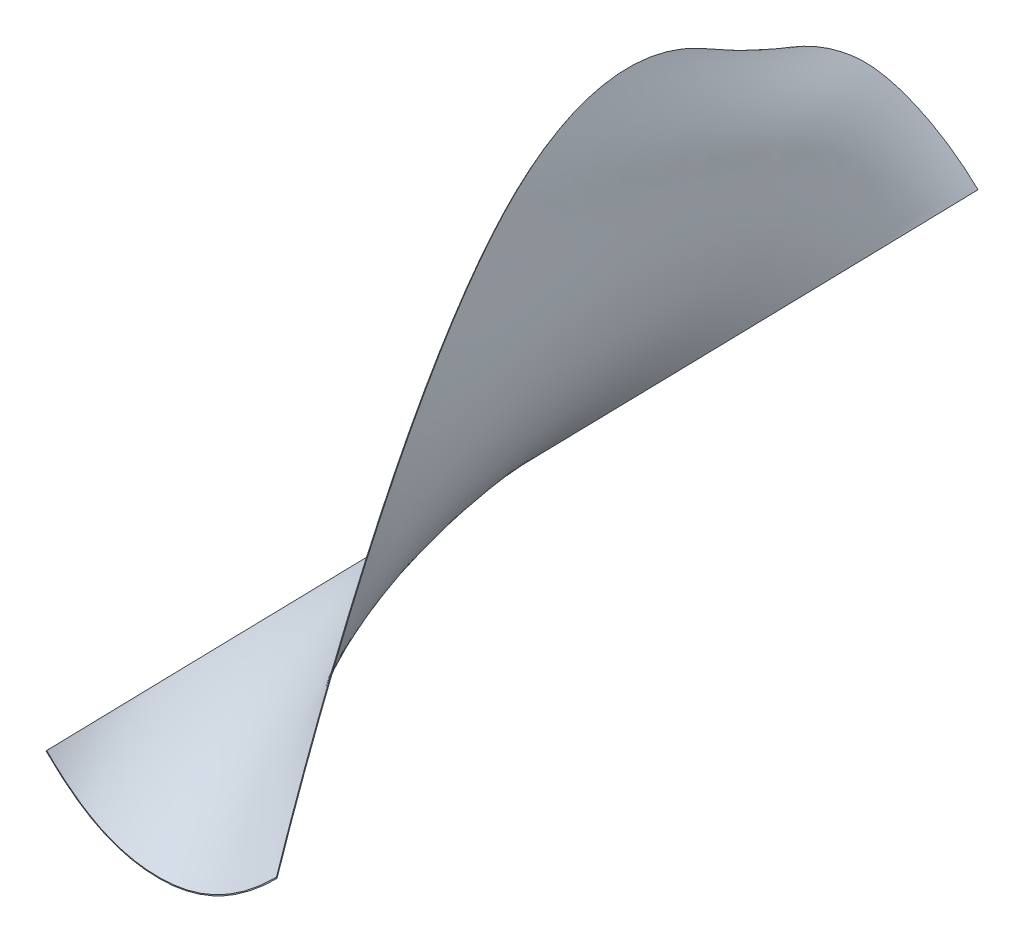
ISO-10303-21;
HEADER;
FILE_DESCRIPTION(('STEP AP214'),'2;1');
FILE_NAME('part.step','',(''),(''),'','','');
FILE_SCHEMA(('AUTOMOTIVE_DESIGN { 1 0 10303 214 1 1 1 1 }'));
ENDSEC;
DATA;
#1=APPLICATION_CONTEXT('core data for automotive mechanical design processes');
#2=APPLICATION_PROTOCOL_DEFINITION('international standard','automotive_design',2000,#1);
#3=PRODUCT_CONTEXT('',#1,'mechanical');
#4=PRODUCT('Part','Part','',(#3));
#5=PRODUCT_RELATED_PRODUCT_CATEGORY('part','',(#4));
#6=PRODUCT_DEFINITION_FORMATION('','',#4);
#7=PRODUCT_DEFINITION_CONTEXT('part definition',#1,'design');
#8=PRODUCT_DEFINITION('design','',#6,#7);
#9=PRODUCT_DEFINITION_SHAPE('','',#8);
#10=(LENGTH_UNIT() NAMED_UNIT(*) SI_UNIT(.MILLI.,.METRE.));
#11=(NAMED_UNIT(*) PLANE_ANGLE_UNIT() SI_UNIT($,.RADIAN.));
#12=(NAMED_UNIT(*) SI_UNIT($,.STERADIAN.) SOLID_ANGLE_UNIT());
#13=UNCERTAINTY_MEASURE_WITH_UNIT(LENGTH_MEASURE(1.E-05),#10,'distance_accuracy_value','');
#14=(GEOMETRIC_REPRESENTATION_CONTEXT(3) GLOBAL_UNCERTAINTY_ASSIGNED_CONTEXT((#13)) GLOBAL_UNIT_ASSIGNED_CONTEXT((#10,
#11,#12)) REPRESENTATION_CONTEXT('',''));
#15=CARTESIAN_POINT('',(0.,0.,0.));
#16=DIRECTION('',(0.,0.,1.));
#17=DIRECTION('',(1.,0.,0.));
#18=AXIS2_PLACEMENT_3D('',#15,#16,#17);
#19=CARTESIAN_POINT('',(-127.735476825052,61.9614146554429,0.));
#20=DIRECTION('',(0.,0.,1.));
#21=DIRECTION('',(1.,0.,0.));
#22=AXIS2_PLACEMENT_3D('',#19,#20,#21);
#23=PLANE('',#22);
#24=CARTESIAN_POINT('',(-249.646446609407,-0.353553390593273,0.));
#25=CARTESIAN_POINT('',(-248.407781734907,0.885111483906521,0.));
#26=CARTESIAN_POINT('',(-245.897723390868,3.34805729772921,0.));
#27=CARTESIAN_POINT('',(-240.859649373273,8.10657595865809,0.));
#28=CARTESIAN_POINT('',(-234.484704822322,13.7904329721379,0.));
#29=CARTESIAN_POINT('',(-226.748220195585,20.1697131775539,0.));
#30=CARTESIAN_POINT('',(-216.340461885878,28.088997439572,0.));
#31=CARTESIAN_POINT('',(-203.213565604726,36.8792838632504,0.));
#32=CARTESIAN_POINT('',(-187.444698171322,45.6330219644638,0.));
#33=CARTESIAN_POINT('',(-171.830910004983,52.5707445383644,0.));
#34=CARTESIAN_POINT('',(-156.545796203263,57.6718646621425,0.));
#35=CARTESIAN_POINT('',(-144.221045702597,60.3747674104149,0.));
#36=CARTESIAN_POINT('',(-134.705792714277,61.5998340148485,0.));
#37=CARTESIAN_POINT('',(-125.410326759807,62.1921800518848,0.));
#38=CARTESIAN_POINT('',(-113.810247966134,61.6924292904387,0.));
#39=CARTESIAN_POINT('',(-98.8242234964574,58.9477901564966,0.));
#40=CARTESIAN_POINT('',(-83.1223347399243,54.195149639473,0.));
#41=CARTESIAN_POINT('',(-61.671413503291,45.3620229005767,0.));
#42=CARTESIAN_POINT('',(-40.115954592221,33.0607640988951,0.));
#43=CARTESIAN_POINT('',(-19.7790161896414,17.8429951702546,0.));
#44=CARTESIAN_POINT('',(-10.2407698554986,9.35821942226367,0.));
#45=CARTESIAN_POINT('',(-5.68060886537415,4.91653393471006,0.));
#46=B_SPLINE_CURVE_WITH_KNOTS('',3,(#24,#25,#26,#27,#28,#29,#30,#31,#32,#33,#34,#35,#36,#37,#38,
#39,#40,#41,#42,#43,#44,#45),.UNSPECIFIED.,.F.,.F.,(4,1,1,1,1,1,1,1,1,1,1,1,1,1,1,1,1,1,1,4),
(0.,0.00778621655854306,0.0155724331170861,0.0311448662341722,0.0467172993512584,
0.0622897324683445,0.0934345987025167,0.124579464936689,0.155724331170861,0.186869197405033,
0.218014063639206,0.233586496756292,0.249158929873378,0.28030379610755,0.311448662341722,
0.342593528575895,0.373738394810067,0.436028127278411,0.467172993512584,0.498317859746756),.UNSPECIFIED.);
#47=CARTESIAN_POINT('',(-249.646446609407,-0.353553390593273,0.));
#48=VERTEX_POINT('',#47);
#49=CARTESIAN_POINT('',(-5.68060886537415,4.91653393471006,0.));
#50=VERTEX_POINT('',#49);
#51=EDGE_CURVE('E203',#48,#50,#46,.T.);
#52=ORIENTED_EDGE('',*,*,#51,.F.);
#53=DIRECTION('',(0.707106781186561,-0.707106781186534,0.));
#54=VECTOR('',#53,1.);
#55=CARTESIAN_POINT('',(-249.646446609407,-0.353553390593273,0.));
#56=LINE('',#55,#54);
#57=CARTESIAN_POINT('',(-250.353553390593,0.353553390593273,0.));
#58=VERTEX_POINT('',#57);
#59=EDGE_CURVE('E223',#58,#48,#56,.T.);
#60=ORIENTED_EDGE('',*,*,#59,.F.);
#61=CARTESIAN_POINT('',(-4.9828689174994,5.63288508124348,0.));
#62=CARTESIAN_POINT('',(-9.56389602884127,10.0948945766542,0.));
#63=CARTESIAN_POINT('',(-19.1466458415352,18.6192566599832,0.));
#64=CARTESIAN_POINT('',(-39.5712553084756,33.9023453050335,0.));
#65=CARTESIAN_POINT('',(-61.2204393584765,46.2578440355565,0.));
#66=CARTESIAN_POINT('',(-82.7829554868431,55.1374322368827,0.));
#67=CARTESIAN_POINT('',(-98.5830480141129,59.9203342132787,0.));
#68=CARTESIAN_POINT('',(-113.690339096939,62.6885425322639,0.));
#69=CARTESIAN_POINT('',(-125.41629141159,63.1942272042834,0.));
#70=CARTESIAN_POINT('',(-134.803431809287,62.5957392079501,0.));
#71=CARTESIAN_POINT('',(-144.399430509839,61.3601288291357,0.));
#72=CARTESIAN_POINT('',(-156.815635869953,58.6367114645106,0.));
#73=CARTESIAN_POINT('',(-172.195808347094,53.5034203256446,0.));
#74=CARTESIAN_POINT('',(-187.893439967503,46.5281387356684,0.));
#75=CARTESIAN_POINT('',(-203.73701408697,37.7326879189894,0.));
#76=CARTESIAN_POINT('',(-216.920029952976,28.9046707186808,0.));
#77=CARTESIAN_POINT('',(-227.369610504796,20.9535397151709,0.));
#78=CARTESIAN_POINT('',(-235.136038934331,14.5495503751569,0.));
#79=CARTESIAN_POINT('',(-241.534825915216,8.84442386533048,0.));
#80=CARTESIAN_POINT('',(-246.591354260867,4.06847125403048,0.));
#81=CARTESIAN_POINT('',(-249.11042041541,1.59668636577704,0.));
#82=CARTESIAN_POINT('',(-250.353553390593,0.353553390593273,0.));
#83=B_SPLINE_CURVE_WITH_KNOTS('',3,(#61,#62,#63,#64,#65,#66,#67,#68,#69,#70,#71,#72,#73,#74,#75,
#76,#77,#78,#79,#80,#81,#82),.UNSPECIFIED.,.F.,.F.,(4,1,1,1,1,1,1,1,1,1,1,1,1,1,1,1,1,1,1,4),
(0.,0.0311448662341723,0.0622897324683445,0.124579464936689,0.155724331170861,0.186869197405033,
0.218014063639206,0.249158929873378,0.264731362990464,0.28030379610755,0.311448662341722,
0.342593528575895,0.373738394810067,0.404883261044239,0.436028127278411,0.451600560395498,
0.467172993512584,0.48274542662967,0.490531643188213,0.498317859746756),.UNSPECIFIED.);
#84=CARTESIAN_POINT('',(-4.9828689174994,5.63288508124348,0.));
#85=VERTEX_POINT('',#84);
#86=EDGE_CURVE('E197',#85,#58,#83,.T.);
#87=ORIENTED_EDGE('',*,*,#86,.F.);
#88=DIRECTION('',(0.697739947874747,0.71635114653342,0.));
#89=VECTOR('',#88,1.);
#90=CARTESIAN_POINT('',(-5.68060886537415,4.91653393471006,0.));
#91=LINE('',#90,#89);
#92=EDGE_CURVE('E201',#50,#85,#91,.T.);
#93=ORIENTED_EDGE('',*,*,#92,.F.);
#94=EDGE_LOOP('',(#52,#60,#87,#93));
#95=FACE_BOUND('',#94,.T.);
#96=ADVANCED_FACE('F158',(#95),#23,.F.);
#97=CARTESIAN_POINT('',(128.853857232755,-62.9487383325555,1000.));
#98=DIRECTION('',(0.,0.,-1.));
#99=DIRECTION('',(-1.,0.,0.));
#100=AXIS2_PLACEMENT_3D('',#97,#98,#99);
#101=PLANE('',#100);
#102=CARTESIAN_POINT('',(4.9474801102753,-5.66012274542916,1000.));
#103=CARTESIAN_POINT('',(7.081143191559,-7.78774388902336,1000.));
#104=CARTESIAN_POINT('',(11.4194054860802,-12.0076426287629,1000.));
#105=CARTESIAN_POINT('',(20.1857361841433,-20.0624301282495,1000.));
#106=CARTESIAN_POINT('',(31.4479700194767,-29.4502876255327,1000.));
#107=CARTESIAN_POINT('',(45.5383930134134,-39.4131309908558,1000.));
#108=CARTESIAN_POINT('',(60.3322342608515,-47.8980998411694,1000.));
#109=CARTESIAN_POINT('',(75.9454882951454,-54.7187372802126,1000.));
#110=CARTESIAN_POINT('',(92.4961984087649,-59.6911074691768,1000.));
#111=CARTESIAN_POINT('',(110.097369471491,-62.6314048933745,1000.));
#112=CARTESIAN_POINT('',(125.742650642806,-63.2358319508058,1000.));
#113=CARTESIAN_POINT('',(138.205326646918,-62.4954365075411,1000.));
#114=CARTESIAN_POINT('',(150.392681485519,-60.8894422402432,1000.));
#115=CARTESIAN_POINT('',(165.024751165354,-57.338978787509,1000.));
#116=CARTESIAN_POINT('',(181.641214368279,-50.9813725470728,1000.));
#117=CARTESIAN_POINT('',(197.308326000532,-42.886043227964,1000.));
#118=CARTESIAN_POINT('',(212.028203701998,-33.4148043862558,1000.));
#119=CARTESIAN_POINT('',(223.505916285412,-24.6753708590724,1000.));
#120=CARTESIAN_POINT('',(232.214954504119,-17.3559058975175,1000.));
#121=CARTESIAN_POINT('',(238.511081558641,-11.7464038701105,1000.));
#122=CARTESIAN_POINT('',(243.558689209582,-7.01216025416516,1000.));
#123=CARTESIAN_POINT('',(247.483717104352,-3.20499340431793,1000.));
#124=CARTESIAN_POINT('',(249.397634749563,-1.30947203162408,1000.));
#125=CARTESIAN_POINT('',(250.353553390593,-0.353553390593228,1000.));
#126=B_SPLINE_CURVE_WITH_KNOTS('',3,(#102,#103,#104,#105,#106,#107,#108,#109,#110,#111,#112,
#113,#114,#115,#116,#117,#118,#119,#120,#121,#122,#123,#124,#125),.UNSPECIFIED.,.F.,.F.,(4,1,1,
1,1,1,1,1,1,1,1,1,1,1,1,1,1,1,1,1,1,4),(0.522819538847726,0.537731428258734,0.552643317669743,
0.58246709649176,0.612290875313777,0.642114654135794,0.671938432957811,0.701762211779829,
0.731585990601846,0.761409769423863,0.776321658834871,0.79123354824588,0.821057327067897,
0.850881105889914,0.880704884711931,0.910528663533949,0.940352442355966,0.955264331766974,
0.970176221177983,0.985088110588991,0.992544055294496,1.),.UNSPECIFIED.);
#127=CARTESIAN_POINT('',(4.9474801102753,-5.66012274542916,1000.));
#128=VERTEX_POINT('',#127);
#129=CARTESIAN_POINT('',(250.353553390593,-0.353553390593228,1000.));
#130=VERTEX_POINT('',#129);
#131=EDGE_CURVE('E328',#128,#130,#126,.T.);
#132=ORIENTED_EDGE('',*,*,#131,.T.);
#133=DIRECTION('',(-0.707106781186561,0.707106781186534,0.));
#134=VECTOR('',#133,1.);
#135=CARTESIAN_POINT('',(250.353553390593,-0.353553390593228,1000.));
#136=LINE('',#135,#134);
#137=CARTESIAN_POINT('',(249.646446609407,0.353553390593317,1000.));
#138=VERTEX_POINT('',#137);
#139=EDGE_CURVE('E321',#130,#138,#136,.T.);
#140=ORIENTED_EDGE('',*,*,#139,.T.);
#141=CARTESIAN_POINT('',(249.646446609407,0.353553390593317,1000.));
#142=CARTESIAN_POINT('',(248.692898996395,-0.599994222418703,1000.));
#143=CARTESIAN_POINT('',(246.783613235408,-2.49092773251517,1000.));
#144=CARTESIAN_POINT('',(242.869015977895,-6.28797224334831,1000.));
#145=CARTESIAN_POINT('',(237.835956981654,-11.0085535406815,1000.));
#146=CARTESIAN_POINT('',(231.560138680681,-16.5999334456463,1000.));
#147=CARTESIAN_POINT('',(222.882238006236,-23.8931927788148,1000.));
#148=CARTESIAN_POINT('',(211.451804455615,-32.5963744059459,1000.));
#149=CARTESIAN_POINT('',(196.804731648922,-42.0203856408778,1000.));
#150=CARTESIAN_POINT('',(181.229115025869,-50.0679419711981,1000.));
#151=CARTESIAN_POINT('',(164.724997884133,-56.3821422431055,1000.));
#152=CARTESIAN_POINT('',(150.202037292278,-59.9056944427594,1000.));
#153=CARTESIAN_POINT('',(138.111632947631,-61.4989714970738,1000.));
#154=CARTESIAN_POINT('',(125.739142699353,-62.2342007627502,1000.));
#155=CARTESIAN_POINT('',(110.197078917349,-61.6337537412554,1000.));
#156=CARTESIAN_POINT('',(92.7232004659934,-58.7143845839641,1000.));
#157=CARTESIAN_POINT('',(76.291988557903,-53.7781030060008,1000.));
#158=CARTESIAN_POINT('',(60.7847170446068,-47.0040865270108,1000.));
#159=CARTESIAN_POINT('',(46.0796010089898,-38.5704583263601,1000.));
#160=CARTESIAN_POINT('',(32.0602896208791,-28.6583660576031,1000.));
#161=CARTESIAN_POINT('',(20.8436142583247,-19.3087837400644,1000.));
#162=CARTESIAN_POINT('',(12.1071764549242,-11.2815399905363,1000.));
#163=CARTESIAN_POINT('',(7.78097808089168,-7.07338438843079,1000.));
#164=CARTESIAN_POINT('',(5.65358359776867,-4.95201409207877,1000.));
#165=B_SPLINE_CURVE_WITH_KNOTS('',3,(#141,#142,#143,#144,#145,#146,#147,#148,#149,#150,#151,
#152,#153,#154,#155,#156,#157,#158,#159,#160,#161,#162,#163,#164),.UNSPECIFIED.,.F.,.F.,(4,1,1,
1,1,1,1,1,1,1,1,1,1,1,1,1,1,1,1,1,1,4),(0.522819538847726,0.53027548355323,0.537731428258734,
0.552643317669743,0.567555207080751,0.58246709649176,0.612290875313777,0.642114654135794,
0.671938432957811,0.701762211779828,0.731585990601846,0.746497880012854,0.761409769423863,
0.79123354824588,0.821057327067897,0.850881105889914,0.880704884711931,0.910528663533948,
0.940352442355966,0.970176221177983,0.985088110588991,1.),.UNSPECIFIED.);
#166=CARTESIAN_POINT('',(5.65358359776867,-4.95201409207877,1000.));
#167=VERTEX_POINT('',#166);
#168=EDGE_CURVE('E169',#138,#167,#165,.T.);
#169=ORIENTED_EDGE('',*,*,#168,.T.);
#170=DIRECTION('',(-0.706103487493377,-0.708108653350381,0.));
#171=VECTOR('',#170,1.);
#172=CARTESIAN_POINT('',(4.9474801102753,-5.66012274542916,1000.));
#173=LINE('',#172,#171);
#174=EDGE_CURVE('E12',#167,#128,#173,.T.);
#175=ORIENTED_EDGE('',*,*,#174,.T.);
#176=EDGE_LOOP('',(#132,#140,#169,#175));
#177=FACE_BOUND('',#176,.T.);
#178=ADVANCED_FACE('F297',(#177),#101,.F.);
#179=CARTESIAN_POINT('',(249.646446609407,0.353553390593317,1000.));
#180=CARTESIAN_POINT('',(193.987290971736,111.2288986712,888.89444559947));
#181=CARTESIAN_POINT('',(-0.60656102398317,388.338741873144,500.081586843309));
#182=CARTESIAN_POINT('',(-194.35162597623,110.678926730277,111.116667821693));
#183=CARTESIAN_POINT('',(-249.646446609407,-0.353553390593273,0.));
#184=CARTESIAN_POINT('',(249.882148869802,0.117851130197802,1000.));
#185=CARTESIAN_POINT('',(194.275375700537,111.150328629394,888.894448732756));
#186=CARTESIAN_POINT('',(-0.239876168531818,388.705351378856,500.081583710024));
#187=CARTESIAN_POINT('',(-194.430189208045,110.967004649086,111.116670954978));
#188=CARTESIAN_POINT('',(-249.882148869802,-0.117851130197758,0.));
#189=CARTESIAN_POINT('',(250.117851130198,-0.117851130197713,1000.));
#190=CARTESIAN_POINT('',(194.563460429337,111.071758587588,888.894451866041));
#191=CARTESIAN_POINT('',(0.126808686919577,389.071960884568,500.081580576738));
#192=CARTESIAN_POINT('',(-194.50875243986,111.255082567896,111.116674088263));
#193=CARTESIAN_POINT('',(-250.117851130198,0.117851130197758,0.));
#194=CARTESIAN_POINT('',(250.353553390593,-0.353553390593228,1000.));
#195=CARTESIAN_POINT('',(194.851545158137,110.993188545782,888.894454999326));
#196=CARTESIAN_POINT('',(0.493493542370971,389.438570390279,500.081577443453));
#197=CARTESIAN_POINT('',(-194.587315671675,111.543160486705,111.116677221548));
#198=CARTESIAN_POINT('',(-250.353553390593,0.353553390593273,0.));
#199=B_SPLINE_SURFACE_WITH_KNOTS('',3,3,((#179,#180,#181,#182,#183),(#184,#185,#186,#187,#188),
(#189,#190,#191,#192,#193),(#194,#195,#196,#197,#198)),.UNSPECIFIED.,.F.,.F.,.F.,(4,4),(4,1,4),
(0.,1.),(0.,0.500056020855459,1.),.UNSPECIFIED.);
#200=CARTESIAN_POINT('',(250.353553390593,-0.353553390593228,1000.));
#201=CARTESIAN_POINT('',(194.851545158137,110.993188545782,888.894454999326));
#202=CARTESIAN_POINT('',(0.493493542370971,389.438570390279,500.081577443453));
#203=CARTESIAN_POINT('',(-194.587315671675,111.543160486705,111.116677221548));
#204=CARTESIAN_POINT('',(-250.353553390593,0.353553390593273,0.));
#205=B_SPLINE_CURVE_WITH_KNOTS('',3,(#200,#201,#202,#203,#204),.UNSPECIFIED.,.F.,.F.,(4,1,4),
(0.,0.500056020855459,1.),.UNSPECIFIED.);
#206=EDGE_CURVE('E368',#130,#58,#205,.T.);
#207=CARTESIAN_POINT('',(249.646446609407,0.353553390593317,1000.));
#208=CARTESIAN_POINT('',(193.987290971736,111.2288986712,888.89444559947));
#209=CARTESIAN_POINT('',(-0.60656102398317,388.338741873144,500.081586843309));
#210=CARTESIAN_POINT('',(-194.35162597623,110.678926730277,111.116667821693));
#211=CARTESIAN_POINT('',(-249.646446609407,-0.353553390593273,0.));
#212=B_SPLINE_CURVE_WITH_KNOTS('',3,(#207,#208,#209,#210,#211),.UNSPECIFIED.,.F.,.F.,(4,1,4),
(0.,0.500056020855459,1.),.UNSPECIFIED.);
#213=EDGE_CURVE('E214',#48,#138,#212,.F.);
#214=ORIENTED_EDGE('',*,*,#139,.F.);
#215=ORIENTED_EDGE('',*,*,#206,.T.);
#216=ORIENTED_EDGE('',*,*,#59,.T.);
#217=ORIENTED_EDGE('',*,*,#213,.T.);
#218=EDGE_LOOP('',(#214,#215,#216,#217));
#219=FACE_BOUND('',#218,.T.);
#220=ADVANCED_FACE('F305',(#219),#199,.T.);
#221=CARTESIAN_POINT('',(250.353553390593,-0.353553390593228,1000.));
#222=CARTESIAN_POINT('',(194.851545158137,110.993188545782,888.894454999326));
#223=CARTESIAN_POINT('',(0.493493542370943,389.438570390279,500.081577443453));
#224=CARTESIAN_POINT('',(-194.587315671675,111.543160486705,111.116677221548));
#225=CARTESIAN_POINT('',(-250.353553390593,0.353553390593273,0.));
#226=CARTESIAN_POINT('',(243.720841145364,-6.98626563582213,1000.));
#227=CARTESIAN_POINT('',(192.609891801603,102.81362409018,888.891424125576));
#228=CARTESIAN_POINT('',(10.8883533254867,379.172211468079,500.08460831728));
#229=CARTESIAN_POINT('',(-186.606823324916,113.722272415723,111.113646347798));
#230=CARTESIAN_POINT('',(-243.755141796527,6.95196498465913,0.));
#231=CARTESIAN_POINT('',(232.775824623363,-17.2168251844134,1000.));
#232=CARTESIAN_POINT('',(188.671485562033,90.114823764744,888.88658790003));
#233=CARTESIAN_POINT('',(26.6865991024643,362.152662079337,500.089444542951));
#234=CARTESIAN_POINT('',(-173.346524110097,116.676597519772,111.10881012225));
#235=CARTESIAN_POINT('',(-232.700165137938,16.9579628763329,0.));
#236=CARTESIAN_POINT('',(217.806393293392,-29.1335398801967,1000.));
#237=CARTESIAN_POINT('',(182.291063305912,74.2152156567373,888.882438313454));
#238=CARTESIAN_POINT('',(45.1896150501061,338.992671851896,500.093594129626));
#239=CARTESIAN_POINT('',(-156.310521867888,119.0143736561,111.104660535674));
#240=CARTESIAN_POINT('',(-217.534892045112,28.4618163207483,0.));
#241=CARTESIAN_POINT('',(206.305914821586,-37.1701753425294,999.999999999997));
#242=CARTESIAN_POINT('',(176.90699315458,62.8892455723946,888.880235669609));
#243=CARTESIAN_POINT('',(57.6563221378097,321.178980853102,500.095796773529));
#244=CARTESIAN_POINT('',(-143.717352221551,119.96306098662,111.102457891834));
#245=CARTESIAN_POINT('',(-205.926268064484,36.2113142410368,0.));
#246=CARTESIAN_POINT('',(196.513763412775,-43.1516924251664,999.999999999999));
#247=CARTESIAN_POINT('',(171.94435327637,53.9045062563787,888.879002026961));
#248=CARTESIAN_POINT('',(66.949595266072,305.996780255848,500.097030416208));
#249=CARTESIAN_POINT('',(-133.418609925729,120.141542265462,111.101224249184));
#250=CARTESIAN_POINT('',(-196.09560094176,42.0100535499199,0.));
#251=CARTESIAN_POINT('',(185.796437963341,-48.8395331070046,1000.));
#252=CARTESIAN_POINT('',(166.138585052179,44.7292081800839,888.878313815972));
#253=CARTESIAN_POINT('',(75.8002721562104,289.352796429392,500.097718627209));
#254=CARTESIAN_POINT('',(-122.566565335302,119.733541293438,111.100536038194));
#255=CARTESIAN_POINT('',(-185.39595950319,47.5946694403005,0.));
#256=CARTESIAN_POINT('',(174.622744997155,-53.7955375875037,999.999999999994));
#257=CARTESIAN_POINT('',(159.660076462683,35.906237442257,888.878297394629));
#258=CARTESIAN_POINT('',(83.5305512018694,271.964790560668,500.097735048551));
#259=CARTESIAN_POINT('',(-111.728477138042,118.636020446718,111.100519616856));
#260=CARTESIAN_POINT('',(-174.305379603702,52.5713135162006,0.));
#261=CARTESIAN_POINT('',(162.201526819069,-57.9835752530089,1000.00000000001));
#262=CARTESIAN_POINT('',(151.877650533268,27.1044789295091,888.879415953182));
#263=CARTESIAN_POINT('',(90.0841752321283,252.583028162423,500.096616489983));
#264=CARTESIAN_POINT('',(-100.305452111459,116.514933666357,111.1016381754));
#265=CARTESIAN_POINT('',(-162.033888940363,56.9727130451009,0.));
#266=CARTESIAN_POINT('',(149.71361576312,-60.971710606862,1000.));
#267=CARTESIAN_POINT('',(143.512204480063,19.1904343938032,888.881490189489));
#268=CARTESIAN_POINT('',(94.7742180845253,233.056578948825,500.094542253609));
#269=CARTESIAN_POINT('',(-89.3718748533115,113.529127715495,111.103712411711));
#270=CARTESIAN_POINT('',(-149.708791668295,60.3209455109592,0.));
#271=CARTESIAN_POINT('',(141.316216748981,-62.1293133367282,999.999999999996));
#272=CARTESIAN_POINT('',(137.5051807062,14.5232788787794,888.883370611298));
#273=CARTESIAN_POINT('',(96.5992224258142,219.912201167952,500.092661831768));
#274=CARTESIAN_POINT('',(-82.3873599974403,110.894986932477,111.105592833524));
#275=CARTESIAN_POINT('',(-141.402710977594,61.7770375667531,0.));
#276=CARTESIAN_POINT('',(133.250509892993,-62.8099902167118,1000.));
#277=CARTESIAN_POINT('',(131.543422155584,10.3835706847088,888.884625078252));
#278=CARTESIAN_POINT('',(97.6733377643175,207.296653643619,500.091407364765));
#279=CARTESIAN_POINT('',(-75.8539245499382,108.002683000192,111.106847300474));
#280=CARTESIAN_POINT('',(-133.40326300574,62.7003989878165,0.));
#281=CARTESIAN_POINT('',(128.221350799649,-63.0331609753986,999.999999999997));
#282=CARTESIAN_POINT('',(127.733849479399,7.96072997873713,888.885141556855));
#283=CARTESIAN_POINT('',(98.0283655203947,199.441299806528,500.090890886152));
#284=CARTESIAN_POINT('',(-71.8634722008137,106.01949634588,111.107363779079));
#285=CARTESIAN_POINT('',(-128.403769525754,63.0423772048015,0.));
#286=CARTESIAN_POINT('',(120.786318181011,-62.9786296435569,999.999999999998));
#287=CARTESIAN_POINT('',(121.930782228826,4.70027805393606,888.883598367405));
#288=CARTESIAN_POINT('',(97.9528338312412,187.878448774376,500.092434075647));
#289=CARTESIAN_POINT('',(-66.1300520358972,102.665540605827,111.105820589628));
#290=CARTESIAN_POINT('',(-121.006185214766,62.9767133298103,0.));
#291=CARTESIAN_POINT('',(113.305280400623,-62.6277925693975,999.999999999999));
#292=CARTESIAN_POINT('',(115.960569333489,1.666422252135,888.880196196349));
#293=CARTESIAN_POINT('',(97.4192064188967,176.285502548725,500.095836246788));
#294=CARTESIAN_POINT('',(-60.498532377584,98.9612877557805,111.102418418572));
#295=CARTESIAN_POINT('',(-113.570706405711,62.4656032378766,0.));
#296=CARTESIAN_POINT('',(104.860886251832,-61.7103559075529,999.999999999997));
#297=CARTESIAN_POINT('',(108.993982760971,-1.32953119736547,888.873838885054));
#298=CARTESIAN_POINT('',(96.0173218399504,163.256083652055,500.102193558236));
#299=CARTESIAN_POINT('',(-54.4008508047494,94.2388890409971,111.096061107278));
#300=CARTESIAN_POINT('',(-105.21818574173,61.1633277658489,0.));
#301=CARTESIAN_POINT('',(95.0291470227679,-59.9910368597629,999.999999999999));
#302=CARTESIAN_POINT('',(100.598803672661,-4.30577871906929,888.86642548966));
#303=CARTESIAN_POINT('',(93.384732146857,148.100156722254,500.109606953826));
#304=CARTESIAN_POINT('',(-47.6211690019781,88.2007193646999,111.088647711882));
#305=CARTESIAN_POINT('',(-95.5393890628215,58.9458891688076,0.));
#306=CARTESIAN_POINT('',(85.6703949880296,-57.6803012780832,1000.));
#307=CARTESIAN_POINT('',(92.3114962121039,-6.61890430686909,888.860790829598));
#308=CARTESIAN_POINT('',(89.8373139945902,133.663385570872,500.115241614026));
#309=CARTESIAN_POINT('',(-41.4851996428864,81.9532604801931,111.08301305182));
#310=CARTESIAN_POINT('',(-86.353929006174,56.1981956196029,0.));
#311=CARTESIAN_POINT('',(76.8993249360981,-54.7813680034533,1000.));
#312=CARTESIAN_POINT('',(84.2180878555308,-8.23101593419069,888.85845014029));
#313=CARTESIAN_POINT('',(85.3681786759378,120.098318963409,500.117582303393));
#314=CARTESIAN_POINT('',(-36.052284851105,75.612284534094,111.080672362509));
#315=CARTESIAN_POINT('',(-77.7340095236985,53.0171630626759,0.));
#316=CARTESIAN_POINT('',(68.0571733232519,-51.296787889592,999.999999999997));
#317=CARTESIAN_POINT('',(75.8059778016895,-9.43301364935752,888.858529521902));
#318=CARTESIAN_POINT('',(79.9788236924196,106.389312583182,500.11750292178));
#319=CARTESIAN_POINT('',(-30.802846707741,68.8649309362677,111.080751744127));
#320=CARTESIAN_POINT('',(-69.0113213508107,49.3719919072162,0.));
#321=CARTESIAN_POINT('',(59.7364206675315,-47.384930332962,1000.));
#322=CARTESIAN_POINT('',(67.6032144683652,-10.0882806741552,888.861243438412));
#323=CARTESIAN_POINT('',(73.9080003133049,93.4491753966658,500.114789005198));
#324=CARTESIAN_POINT('',(-26.1087569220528,62.1188263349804,111.083465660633));
#325=CARTESIAN_POINT('',(-60.7503567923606,45.4528221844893,0.));
#326=CARTESIAN_POINT('',(49.4449254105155,-41.6719485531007,1000.));
#327=CARTESIAN_POINT('',(57.0576917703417,-10.2396425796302,888.867298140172));
#328=CARTESIAN_POINT('',(65.0107788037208,77.3917104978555,500.108734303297));
#329=CARTESIAN_POINT('',(-20.6243105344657,53.2210966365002,111.089520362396));
#330=CARTESIAN_POINT('',(-50.4320674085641,39.920295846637,0.));
#331=CARTESIAN_POINT('',(37.8511368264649,-34.1791138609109,1000.));
#332=CARTESIAN_POINT('',(44.6944256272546,-9.61022967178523,888.876089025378));
#333=CARTESIAN_POINT('',(53.3071083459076,59.2495921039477,500.09994341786));
#334=CARTESIAN_POINT('',(-14.8291114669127,42.5033085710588,111.098311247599));
#335=CARTESIAN_POINT('',(-38.6781631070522,32.8249824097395,0.));
#336=CARTESIAN_POINT('',(27.4794106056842,-26.18117322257,1000.));
#337=CARTESIAN_POINT('',(33.0386259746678,-8.05363059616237,888.883278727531));
#338=CARTESIAN_POINT('',(40.7864196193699,42.9750769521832,500.092753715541));
#339=CARTESIAN_POINT('',(-10.1273625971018,32.0115344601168,111.105500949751));
#340=CARTESIAN_POINT('',(-28.0232017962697,25.3276482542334,0.));
#341=CARTESIAN_POINT('',(16.0603559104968,-16.4053984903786,999.999999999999));
#342=CARTESIAN_POINT('',(19.7850067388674,-5.58724662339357,888.888279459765));
#343=CARTESIAN_POINT('',(25.4835006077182,25.0795913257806,500.087752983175));
#344=CARTESIAN_POINT('',(-5.37503937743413,19.663222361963,111.110501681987));
#345=CARTESIAN_POINT('',(-16.2809161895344,16.0669530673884,0.));
#346=CARTESIAN_POINT('',(9.63070461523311,-10.3300856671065,1000.));
#347=CARTESIAN_POINT('',(12.0211361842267,-3.72135436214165,888.888661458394));
#348=CARTESIAN_POINT('',(16.011217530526,14.9668692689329,500.08737098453));
#349=CARTESIAN_POINT('',(-2.97013278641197,12.3062355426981,111.110883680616));
#350=CARTESIAN_POINT('',(-9.69614767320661,10.2237102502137,0.));
#351=CARTESIAN_POINT('',(4.9474801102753,-5.66012274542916,1000.));
#352=CARTESIAN_POINT('',(6.33977577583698,-2.20047939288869,888.888947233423));
#353=CARTESIAN_POINT('',(8.71800566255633,7.70242655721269,500.087085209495));
#354=CARTESIAN_POINT('',(-1.38382902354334,6.58297113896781,111.111169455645));
#355=CARTESIAN_POINT('',(-4.9828689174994,5.63288508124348,0.));
#356=B_SPLINE_SURFACE_WITH_KNOTS('',3,3,((#221,#222,#223,#224,#225),(#226,#227,#228,#229,#230),
(#231,#232,#233,#234,#235),(#236,#237,#238,#239,#240),(#241,#242,#243,#244,#245),(#246,#247,
#248,#249,#250),(#251,#252,#253,#254,#255),(#256,#257,#258,#259,#260),(#261,#262,#263,#264,
#265),(#266,#267,#268,#269,#270),(#271,#272,#273,#274,#275),(#276,#277,#278,#279,#280),(#281,
#282,#283,#284,#285),(#286,#287,#288,#289,#290),(#291,#292,#293,#294,#295),(#296,#297,#298,#299,
#300),(#301,#302,#303,#304,#305),(#306,#307,#308,#309,#310),(#311,#312,#313,#314,#315),(#316,
#317,#318,#319,#320),(#321,#322,#323,#324,#325),(#326,#327,#328,#329,#330),(#331,#332,#333,#334,
#335),(#336,#337,#338,#339,#340),(#341,#342,#343,#344,#345),(#346,#347,#348,#349,#350),(#351,
#352,#353,#354,#355)),.UNSPECIFIED.,.F.,.F.,.F.,(4,1,1,1,1,1,1,1,1,2,1,1,1,1,1,1,1,1,1,1,1,1,1,
4),(4,1,4),(0.,0.100184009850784,0.159859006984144,0.204246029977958,0.249973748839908,
0.282344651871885,0.333789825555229,0.380389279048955,0.422200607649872,0.470799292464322,
0.508652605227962,0.524528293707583,0.550202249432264,0.58861676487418,0.615185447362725,
0.656766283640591,0.691483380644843,0.713789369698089,0.75824995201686,0.789601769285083,
0.839462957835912,0.90557773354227,0.929362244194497,1.),(0.,0.500056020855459,1.),.UNSPECIFIED.);
#357=CARTESIAN_POINT('',(4.9474801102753,-5.66012274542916,1000.));
#358=CARTESIAN_POINT('',(6.33977577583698,-2.20047939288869,888.888947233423));
#359=CARTESIAN_POINT('',(8.71800566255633,7.70242655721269,500.087085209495));
#360=CARTESIAN_POINT('',(-1.38382902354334,6.58297113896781,111.111169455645));
#361=CARTESIAN_POINT('',(-4.9828689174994,5.63288508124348,0.));
#362=B_SPLINE_CURVE_WITH_KNOTS('',3,(#357,#358,#359,#360,#361),.UNSPECIFIED.,.F.,.F.,(4,1,4),
(0.,0.500056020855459,1.),.UNSPECIFIED.);
#363=EDGE_CURVE('E222',#128,#85,#362,.T.);
#364=ORIENTED_EDGE('',*,*,#131,.F.);
#365=ORIENTED_EDGE('',*,*,#363,.T.);
#366=ORIENTED_EDGE('',*,*,#86,.T.);
#367=ORIENTED_EDGE('',*,*,#206,.F.);
#368=EDGE_LOOP('',(#364,#365,#366,#367));
#369=FACE_BOUND('',#368,.T.);
#370=ADVANCED_FACE('F255',(#369),#356,.T.);
#371=CARTESIAN_POINT('',(5.65358359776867,-4.95201409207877,1000.));
#372=CARTESIAN_POINT('',(6.57332355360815,-1.33498882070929,888.888976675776));
#373=CARTESIAN_POINT('',(7.61430201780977,8.80322369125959,500.08705576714));
#374=CARTESIAN_POINT('',(-2.24215947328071,6.34054853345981,111.111198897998));
#375=CARTESIAN_POINT('',(-5.68060886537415,4.91653393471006,0.));
#376=CARTESIAN_POINT('',(10.3703330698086,-9.65540704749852,1000.));
#377=CARTESIAN_POINT('',(12.2939695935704,-2.86609815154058,888.888652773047));
#378=CARTESIAN_POINT('',(14.9604177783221,16.1182756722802,500.087379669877));
#379=CARTESIAN_POINT('',(-3.83982516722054,12.1069166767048,111.110874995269));
#380=CARTESIAN_POINT('',(-10.4276579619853,9.54025207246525,0.));
#381=CARTESIAN_POINT('',(17.6980659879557,-16.5755639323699,1000.));
#382=CARTESIAN_POINT('',(21.1398443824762,-4.98897138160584,888.888162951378));
#383=CARTESIAN_POINT('',(25.7509112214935,27.6427590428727,500.087869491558));
#384=CARTESIAN_POINT('',(-6.5834620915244,20.489400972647,111.110385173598));
#385=CARTESIAN_POINT('',(-17.9339476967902,16.1947647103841,0.));
#386=CARTESIAN_POINT('',(30.0921809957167,-27.0274647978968,999.999999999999));
#387=CARTESIAN_POINT('',(35.4517483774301,-7.53850654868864,888.881974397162));
#388=CARTESIAN_POINT('',(42.1182982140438,47.0673271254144,500.09405804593));
#389=CARTESIAN_POINT('',(-11.8181562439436,33.7627147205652,111.104196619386));
#390=CARTESIAN_POINT('',(-30.6880105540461,26.0694364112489,0.));
#391=CARTESIAN_POINT('',(40.7262757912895,-34.9324242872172,999.999999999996));
#392=CARTESIAN_POINT('',(47.2689528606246,-8.90701450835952,888.873978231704));
#393=CARTESIAN_POINT('',(54.4893198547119,63.749333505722,500.102054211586));
#394=CARTESIAN_POINT('',(-16.7538117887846,44.3009213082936,111.096200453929));
#395=CARTESIAN_POINT('',(-41.5878397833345,33.4786594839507,0.));
#396=CARTESIAN_POINT('',(52.5584263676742,-42.3593957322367,1000.));
#397=CARTESIAN_POINT('',(59.7856696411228,-9.38247019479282,888.865254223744));
#398=CARTESIAN_POINT('',(66.0841657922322,82.2541846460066,500.110778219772));
#399=CARTESIAN_POINT('',(-22.7481864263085,55.0927525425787,111.087476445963));
#400=CARTESIAN_POINT('',(-53.5567405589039,40.5371069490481,0.));
#401=CARTESIAN_POINT('',(61.8736994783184,-47.3354488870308,999.999999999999));
#402=CARTESIAN_POINT('',(69.2415593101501,-9.09817496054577,888.8601990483));
#403=CARTESIAN_POINT('',(73.8273391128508,96.7777774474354,500.115833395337));
#404=CARTESIAN_POINT('',(-27.7829628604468,63.0206516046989,111.082421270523));
#405=CARTESIAN_POINT('',(-62.8720784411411,45.388793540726,0.));
#406=CARTESIAN_POINT('',(72.0162583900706,-51.9012584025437,1000.00000000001));
#407=CARTESIAN_POINT('',(79.1483931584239,-8.14730025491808,888.857776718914));
#408=CARTESIAN_POINT('',(80.907205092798,112.538030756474,500.118255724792));
#409=CARTESIAN_POINT('',(-33.5827708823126,71.1179048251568,111.079998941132));
#410=CARTESIAN_POINT('',(-72.9238229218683,50.0111346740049,0.));
#411=CARTESIAN_POINT('',(81.7301934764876,-55.4561550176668,1000.));
#412=CARTESIAN_POINT('',(88.2660547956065,-6.62173340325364,888.858965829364));
#413=CARTESIAN_POINT('',(86.3962905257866,127.580549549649,500.117066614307));
#414=CARTESIAN_POINT('',(-39.4556576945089,78.3617596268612,111.081188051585));
#415=CARTESIAN_POINT('',(-82.4834336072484,53.8083393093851,0.));
#416=CARTESIAN_POINT('',(91.8123347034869,-58.2302458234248,999.999999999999));
#417=CARTESIAN_POINT('',(97.3201962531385,-4.34654723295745,888.864105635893));
#418=CARTESIAN_POINT('',(90.660963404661,143.144451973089,500.111926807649));
#419=CARTESIAN_POINT('',(-45.939299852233,85.2862919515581,111.086327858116));
#420=CARTESIAN_POINT('',(-92.3784466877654,57.0119753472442,0.));
#421=CARTESIAN_POINT('',(100.117543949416,-59.9206471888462,999.999999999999));
#422=CARTESIAN_POINT('',(104.516093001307,-2.01745465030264,888.870165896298));
#423=CARTESIAN_POINT('',(93.2515635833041,155.947160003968,500.105866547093));
#424=CARTESIAN_POINT('',(-51.5519212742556,90.5719579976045,111.09238811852));
#425=CARTESIAN_POINT('',(-100.541331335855,59.1228834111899,0.));
#426=CARTESIAN_POINT('',(108.307843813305,-61.1208187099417,1000.));
#427=CARTESIAN_POINT('',(111.408254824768,0.643199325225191,888.87659169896));
#428=CARTESIAN_POINT('',(95.0874087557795,168.574899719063,500.099440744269));
#429=CARTESIAN_POINT('',(-57.3122521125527,95.4165348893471,111.098813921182));
#430=CARTESIAN_POINT('',(-108.618522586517,60.7306129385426,0.));
#431=CARTESIAN_POINT('',(115.541692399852,-61.7584722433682,1000.));
#432=CARTESIAN_POINT('',(117.311622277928,3.32966602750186,888.881620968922));
#433=CARTESIAN_POINT('',(96.0611949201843,179.748016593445,500.094411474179));
#434=CARTESIAN_POINT('',(-62.6100677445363,99.3189565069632,111.103843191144));
#435=CARTESIAN_POINT('',(-115.786193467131,61.6563286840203,0.));
#436=CARTESIAN_POINT('',(122.474054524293,-62.0156093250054,999.999999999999));
#437=CARTESIAN_POINT('',(122.813952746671,6.19776438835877,888.884359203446));
#438=CARTESIAN_POINT('',(96.4507877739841,190.500318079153,500.091673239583));
#439=CARTESIAN_POINT('',(-67.8606260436,102.675594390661,111.106581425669));
#440=CARTESIAN_POINT('',(-122.678978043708,62.0273172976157,0.));
#441=CARTESIAN_POINT('',(129.242918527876,-62.0024783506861,999.999999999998));
#442=CARTESIAN_POINT('',(128.069214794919,9.21851051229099,888.885355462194));
#443=CARTESIAN_POINT('',(96.4222409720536,201.035899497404,500.090676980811));
#444=CARTESIAN_POINT('',(-73.1089647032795,105.659149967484,111.107577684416));
#445=CARTESIAN_POINT('',(-129.414727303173,61.9926177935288,0.));
#446=CARTESIAN_POINT('',(134.180941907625,-61.7377180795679,1000.));
#447=CARTESIAN_POINT('',(131.788779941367,11.6338880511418,888.88471319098));
#448=CARTESIAN_POINT('',(96.0021018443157,208.752448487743,500.09131925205));
#449=CARTESIAN_POINT('',(-77.0455770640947,107.562882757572,111.106935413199));
#450=CARTESIAN_POINT('',(-134.320419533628,61.599600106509,0.));
#451=CARTESIAN_POINT('',(140.901642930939,-61.1465027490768,999.999999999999));
#452=CARTESIAN_POINT('',(136.745984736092,15.1030169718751,888.883553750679));
#453=CARTESIAN_POINT('',(95.068971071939,219.264999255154,500.092478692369));
#454=CARTESIAN_POINT('',(-82.4990487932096,109.951698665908,111.105775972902));
#455=CARTESIAN_POINT('',(-140.984771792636,60.8017528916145,0.));
#456=CARTESIAN_POINT('',(148.396493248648,-60.1541925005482,1000.));
#457=CARTESIAN_POINT('',(142.125388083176,19.2359492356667,888.881857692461));
#458=CARTESIAN_POINT('',(93.5046715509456,230.996205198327,500.094174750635));
#459=CARTESIAN_POINT('',(-88.7164954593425,112.336147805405,111.104079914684));
#460=CARTESIAN_POINT('',(-148.40023976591,59.5460848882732,0.));
#461=CARTESIAN_POINT('',(160.109240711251,-57.5346658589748,999.999999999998));
#462=CARTESIAN_POINT('',(150.053155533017,26.5186326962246,888.879693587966));
#463=CARTESIAN_POINT('',(89.3908366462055,249.315723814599,500.096338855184));
#464=CARTESIAN_POINT('',(-98.890643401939,115.266392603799,111.10191581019));
#465=CARTESIAN_POINT('',(-159.961352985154,56.5695930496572,0.));
#466=CARTESIAN_POINT('',(172.309687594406,-53.6046971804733,1000.));
#467=CARTESIAN_POINT('',(157.778219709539,35.0240533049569,888.878353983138));
#468=CARTESIAN_POINT('',(83.2380889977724,268.360326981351,500.097678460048));
#469=CARTESIAN_POINT('',(-110.025860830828,117.474964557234,111.10057620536));
#470=CARTESIAN_POINT('',(-172.009831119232,52.4036036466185,0.));
#471=CARTESIAN_POINT('',(185.542008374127,-47.9484184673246,1000.00000000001));
#472=CARTESIAN_POINT('',(165.543670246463,45.3106425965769,888.878074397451));
#473=CARTESIAN_POINT('',(74.4118970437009,288.960715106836,500.09795804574));
#474=CARTESIAN_POINT('',(-122.759448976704,118.918864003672,111.100296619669));
#475=CARTESIAN_POINT('',(-185.13349531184,46.6907877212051,0.));
#476=CARTESIAN_POINT('',(198.463408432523,-40.9649696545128,999.999999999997));
#477=CARTESIAN_POINT('',(172.488309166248,56.4683790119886,888.879066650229));
#478=CARTESIAN_POINT('',(63.5472529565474,309.021885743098,500.096965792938));
#479=CARTESIAN_POINT('',(-135.904093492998,119.326795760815,111.101288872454));
#480=CARTESIAN_POINT('',(-198.040832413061,39.8527195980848,0.));
#481=CARTESIAN_POINT('',(210.158477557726,-33.3724987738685,999.999999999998));
#482=CARTESIAN_POINT('',(178.219581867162,67.5433883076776,888.880910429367));
#483=CARTESIAN_POINT('',(51.7588472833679,327.143417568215,500.095122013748));
#484=CARTESIAN_POINT('',(-148.424348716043,118.791601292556,111.103132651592));
#485=CARTESIAN_POINT('',(-209.81311348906,32.5188787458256,0.));
#486=CARTESIAN_POINT('',(222.194762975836,-24.5077714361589,1000.));
#487=CARTESIAN_POINT('',(183.655744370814,79.7484553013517,888.883666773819));
#488=CARTESIAN_POINT('',(38.010788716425,345.781492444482,500.092365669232));
#489=CARTESIAN_POINT('',(-161.8190839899,117.458560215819,111.105888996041));
#490=CARTESIAN_POINT('',(-221.984050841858,23.9735604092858,0.));
#491=CARTESIAN_POINT('',(235.262738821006,-13.5707998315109,1000.00000000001));
#492=CARTESIAN_POINT('',(188.989529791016,94.0447698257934,888.887884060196));
#493=CARTESIAN_POINT('',(21.0284251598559,366.002138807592,500.088148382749));
#494=CARTESIAN_POINT('',(-176.931447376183,114.996611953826,111.110106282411));
#495=CARTESIAN_POINT('',(-235.228354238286,13.3884140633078,0.));
#496=CARTESIAN_POINT('',(244.824920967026,-4.46797225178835,1000.));
#497=CARTESIAN_POINT('',(192.363373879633,105.296831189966,888.892210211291));
#498=CARTESIAN_POINT('',(6.93791134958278,380.867888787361,500.083822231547));
#499=CARTESIAN_POINT('',(-188.532218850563,112.264913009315,111.114432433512));
#500=CARTESIAN_POINT('',(-244.849791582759,4.44310163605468,0.));
#501=CARTESIAN_POINT('',(249.646446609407,0.353553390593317,1000.));
#502=CARTESIAN_POINT('',(193.987290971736,111.2288986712,888.89444559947));
#503=CARTESIAN_POINT('',(-0.606561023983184,388.338741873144,500.081586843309));
#504=CARTESIAN_POINT('',(-194.35162597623,110.678926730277,111.116667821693));
#505=CARTESIAN_POINT('',(-249.646446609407,-0.353553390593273,0.));
#506=B_SPLINE_SURFACE_WITH_KNOTS('',3,3,((#371,#372,#373,#374,#375),(#376,#377,#378,#379,#380),
(#381,#382,#383,#384,#385),(#386,#387,#388,#389,#390),(#391,#392,#393,#394,#395),(#396,#397,
#398,#399,#400),(#401,#402,#403,#404,#405),(#406,#407,#408,#409,#410),(#411,#412,#413,#414,
#415),(#416,#417,#418,#419,#420),(#421,#422,#423,#424,#425),(#426,#427,#428,#429,#430),(#431,
#432,#433,#434,#435),(#436,#437,#438,#439,#440),(#441,#442,#443,#444,#445),(#446,#447,#448,#449,
#450),(#451,#452,#453,#454,#455),(#456,#457,#458,#459,#460),(#461,#462,#463,#464,#465),(#466,
#467,#468,#469,#470),(#471,#472,#473,#474,#475),(#476,#477,#478,#479,#480),(#481,#482,#483,#484,
#485),(#486,#487,#488,#489,#490),(#491,#492,#493,#494,#495),(#496,#497,#498,#499,#500),(#501,
#502,#503,#504,#505)),.UNSPECIFIED.,.F.,.F.,.F.,(4,1,1,1,1,1,1,1,1,1,1,1,1,1,2,1,1,1,1,1,1,1,1,
4),(4,1,4),(0.,0.0715432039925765,0.108191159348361,0.174098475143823,0.213718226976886,
0.25816259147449,0.287443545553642,0.33313826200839,0.369149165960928,0.399680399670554,
0.424126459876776,0.45803137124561,0.477632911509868,0.498620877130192,0.530718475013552,
0.571083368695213,0.611841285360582,0.659504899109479,0.708598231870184,0.766259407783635,
0.817082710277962,0.858266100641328,0.926763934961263,1.),(0.,0.500056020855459,1.),.UNSPECIFIED.);
#507=CARTESIAN_POINT('',(5.65358359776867,-4.95201409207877,1000.));
#508=CARTESIAN_POINT('',(6.57332355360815,-1.33498882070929,888.888976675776));
#509=CARTESIAN_POINT('',(7.61430201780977,8.80322369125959,500.08705576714));
#510=CARTESIAN_POINT('',(-2.24215947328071,6.34054853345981,111.111198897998));
#511=CARTESIAN_POINT('',(-5.68060886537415,4.91653393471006,0.));
#512=B_SPLINE_CURVE_WITH_KNOTS('',3,(#507,#508,#509,#510,#511),.UNSPECIFIED.,.F.,.F.,(4,1,4),
(0.,0.500056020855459,1.),.UNSPECIFIED.);
#513=EDGE_CURVE('E178',#167,#50,#512,.T.);
#514=ORIENTED_EDGE('',*,*,#168,.F.);
#515=ORIENTED_EDGE('',*,*,#213,.F.);
#516=ORIENTED_EDGE('',*,*,#51,.T.);
#517=ORIENTED_EDGE('',*,*,#513,.F.);
#518=EDGE_LOOP('',(#514,#515,#516,#517));
#519=FACE_BOUND('',#518,.T.);
#520=ADVANCED_FACE('F212',(#519),#506,.T.);
#521=CARTESIAN_POINT('',(4.9474801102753,-5.66012274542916,1000.));
#522=CARTESIAN_POINT('',(6.33977577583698,-2.20047939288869,888.888947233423));
#523=CARTESIAN_POINT('',(8.71800566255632,7.70242655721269,500.087085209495));
#524=CARTESIAN_POINT('',(-1.38382902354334,6.58297113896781,111.111169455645));
#525=CARTESIAN_POINT('',(-4.9828689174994,5.63288508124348,0.));
#526=CARTESIAN_POINT('',(5.18284793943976,-5.42408652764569,1000.));
#527=CARTESIAN_POINT('',(6.41762503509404,-1.91198253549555,888.88895704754));
#528=CARTESIAN_POINT('',(8.3501044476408,8.06935893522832,500.087075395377));
#529=CARTESIAN_POINT('',(-1.6699391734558,6.50216360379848,111.111179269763));
#530=CARTESIAN_POINT('',(-5.21544890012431,5.39410136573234,0.));
#531=CARTESIAN_POINT('',(5.41821576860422,-5.18805030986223,1000.));
#532=CARTESIAN_POINT('',(6.49547429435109,-1.62348567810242,888.888966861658));
#533=CARTESIAN_POINT('',(7.98220323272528,8.43629131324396,500.087065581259));
#534=CARTESIAN_POINT('',(-1.95604932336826,6.42135606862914,111.111189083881));
#535=CARTESIAN_POINT('',(-5.44802888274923,5.1553176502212,0.));
#536=CARTESIAN_POINT('',(5.65358359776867,-4.95201409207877,1000.));
#537=CARTESIAN_POINT('',(6.57332355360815,-1.33498882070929,888.888976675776));
#538=CARTESIAN_POINT('',(7.61430201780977,8.80322369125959,500.08705576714));
#539=CARTESIAN_POINT('',(-2.24215947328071,6.34054853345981,111.111198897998));
#540=CARTESIAN_POINT('',(-5.68060886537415,4.91653393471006,0.));
#541=B_SPLINE_SURFACE_WITH_KNOTS('',3,3,((#521,#522,#523,#524,#525),(#526,#527,#528,#529,#530),
(#531,#532,#533,#534,#535),(#536,#537,#538,#539,#540)),.UNSPECIFIED.,.F.,.F.,.F.,(4,4),(4,1,4),
(0.,1.),(0.,0.500056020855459,1.),.UNSPECIFIED.);
#542=ORIENTED_EDGE('',*,*,#174,.F.);
#543=ORIENTED_EDGE('',*,*,#513,.T.);
#544=ORIENTED_EDGE('',*,*,#92,.T.);
#545=ORIENTED_EDGE('',*,*,#363,.F.);
#546=EDGE_LOOP('',(#542,#543,#544,#545));
#547=FACE_BOUND('',#546,.T.);
#548=ADVANCED_FACE('F219',(#547),#541,.T.);
#549=CLOSED_SHELL('',(#96,#178,#220,#370,#520,#548));
#550=MANIFOLD_SOLID_BREP('B2',#549);
#551=ADVANCED_BREP_SHAPE_REPRESENTATION('',(#18,#550),#14);
#552=SHAPE_DEFINITION_REPRESENTATION(#9,#551);
ENDSEC;
END-ISO-10303-21;
